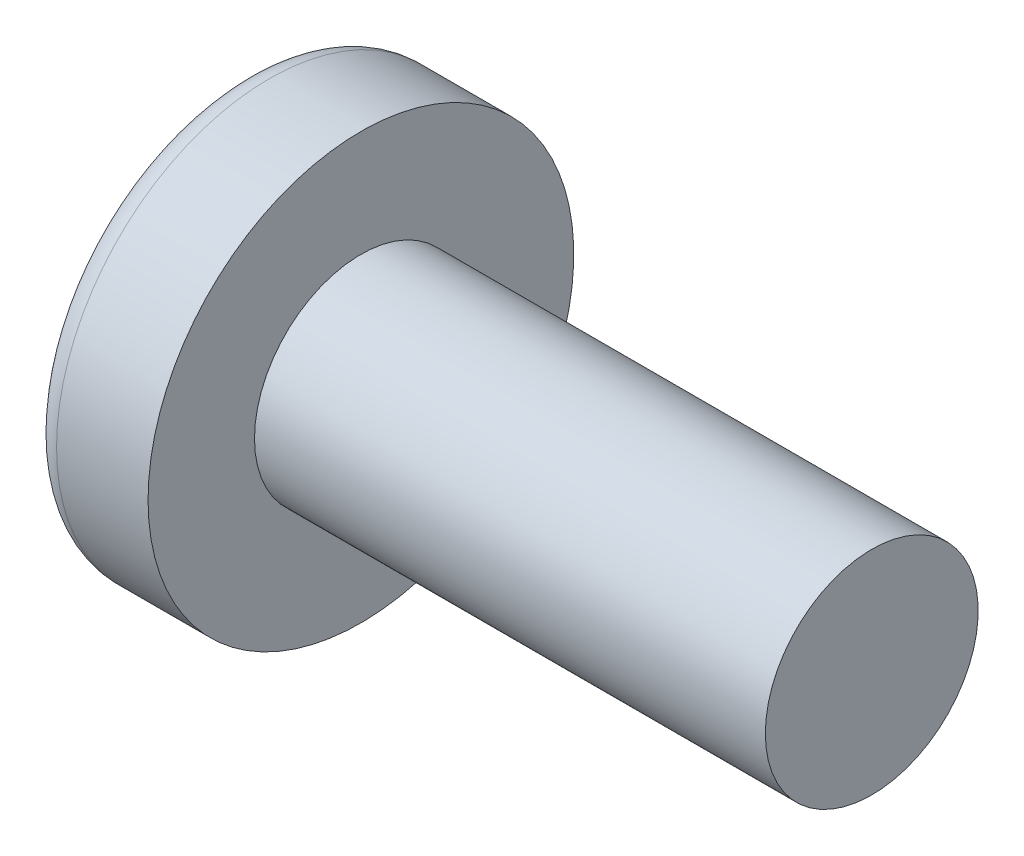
from build123d import *

# Parameters (mm, degrees)
CIRPATTERN1_COUNT = 2
CIRPATTERN1_ANGLE = 90


with BuildPart() as part:
    # BodySke → Base-Revolve (revolve)
    with BuildSketch(Plane.XY, mode=Mode.PRIVATE) as base_revolve_sk:
        with BuildLine():
            Line((2.1, 1.25), (2.1, 2.5))
            Line((2.1, 2.5), (1.025105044, 2.5))
            ThreePointArc((1.025105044, 2.5), (0.890037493, 2.467874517), (0.783897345, 2.378378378))
            ThreePointArc((0.783897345, 2.378378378), (0.201025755, 1.252116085), (0, 0))
            Line((0, 0), (8.1, 0))
            Line((8.1, 0), (8.1, 1.25))
            Line((8.1, 1.25), (2.1, 1.25))
        make_face()
    revolve(base_revolve_sk.sketch.rotate(Axis((-25.4, 0, 0), (1, 0, 0)), 90), axis=Axis((-25.4, 0, 0), (1, 0, 0)))

    # Sketch3 → Cut-Loft1 section 0
    with BuildSketch(Plane(origin=(0, 0, 0), x_dir=(0, 0, -1), z_dir=(1, 0, 0))):
        with BuildLine():
            Line((0.35, -1.34), (-0.35, -1.34))
            Line((-0.35, -1.34), (-0.35, 1.34))
            Line((-0.35, 1.34), (0.35, 1.34))
            Line((0.35, 1.34), (0.35, -1.34))
        make_face()
    # Sketch4 → Cut-Loft1 section 1
    with BuildSketch(Plane(origin=(1.53, 0, 0), x_dir=(0, 0, -1), z_dir=(1, 0, 0))):
        with BuildLine():
            Line((0.175, -0.175), (-0.175, -0.175))
            Line((-0.175, -0.175), (-0.175, 0.175))
            Line((-0.175, 0.175), (0.175, 0.175))
            Line((0.175, 0.175), (0.175, -0.175))
        make_face()
    cut_loft1 = loft(mode=Mode.SUBTRACT)

    # CirPattern1: Cut-Loft1 ×2 about axis
    cirpattern1_axis = Axis((0, 0, 0), (1, 0, 0))
    for i in range(1, CIRPATTERN1_COUNT):
        add(cut_loft1.rotate(cirpattern1_axis, i * CIRPATTERN1_ANGLE / (CIRPATTERN1_COUNT - 1)), mode=Mode.SUBTRACT)


solid = part.part
